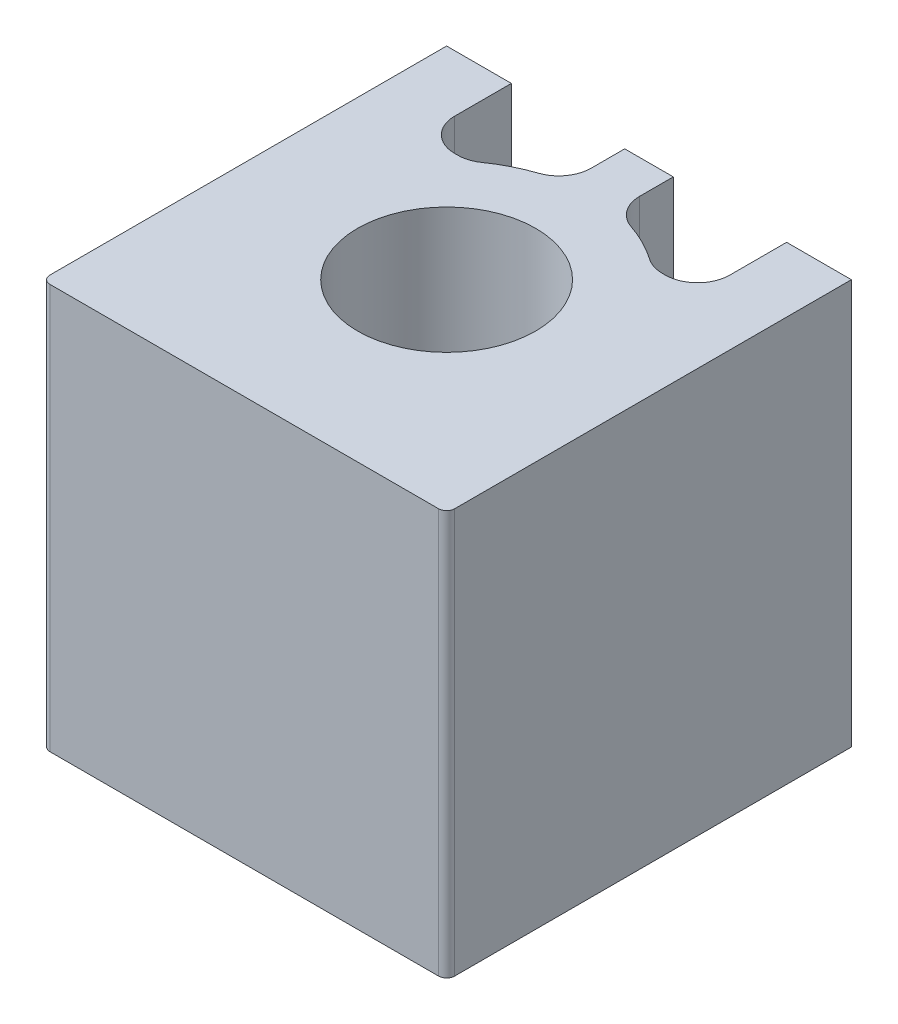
from build123d import *

# Parameters (mm, degrees)
EXTRUSION1_DEPTH        = 25
ESQUISSE2_R             = 5.5
ENL_V_MAT_EXTRU_1_DEPTH = 25
CONG_2_R                = 2


with BuildPart() as part:
    # Esquisse1 → Extrusion1 (new body)
    with BuildSketch(Plane(origin=(0, 0, 0), x_dir=(1, 0, 0), z_dir=(0, 1, 0))):
        with BuildLine():
            Line((0.5, 0), (24.5, 0))
            ThreePointArc((24.5, 0), (24.853553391, 0.146446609), (25, 0.5))
            Line((25, 0.5), (25, 25))
            Line((25, 25), (0, 25))
            Line((0, 25), (0, 0.5))
            ThreePointArc((0, 0.5), (0.146446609, 0.146446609), (0.5, 0))
        make_face()
    extrude(amount=EXTRUSION1_DEPTH)

    # Esquisse2 → Enl_v. mat.-Extru.1 (cut)
    with BuildSketch(Plane.XZ):
        with Locations(Location((12.5, -12.5, 0), (0, 0, 270))):
            Circle(ESQUISSE2_R)
        with BuildLine():
            Line((4, -30.5), (11, -30.5))
            Line((11, -30.5), (11, -21.374119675))
            ThreePointArc((11, -21.374119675), (8.800916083, -20.70468026), (6.843145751, -19.5))
            Line((6.843145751, -19.5), (4, -19.5))
            Line((4, -19.5), (4, -30.5))
        make_face()
        with BuildLine():
            Line((21, -19.5), (18.156854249, -19.5))
            ThreePointArc((18.156854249, -19.5), (16.199083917, -20.70468026), (14, -21.374119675))
            Line((14, -21.374119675), (14, -30.5))
            Line((14, -30.5), (21, -30.5))
            Line((21, -30.5), (21, -19.5))
        make_face()
    extrude(amount=-ENL_V_MAT_EXTRU_1_DEPTH, mode=Mode.SUBTRACT)

    # Cong_2
    cong_2_edges = [part.edges().sort_by_distance(p)[0] for p in [
        (11, 12.5, -21.374119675),
        (4, 12.5, -19.5),
        (6.843145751, 12.5, -19.5),
        (21, 12.5, -19.5),
        (14, 12.5, -21.374119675),
        (18.156854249, 12.5, -19.5),
    ]]
    fillet(cong_2_edges, radius=CONG_2_R)


solid = part.part
